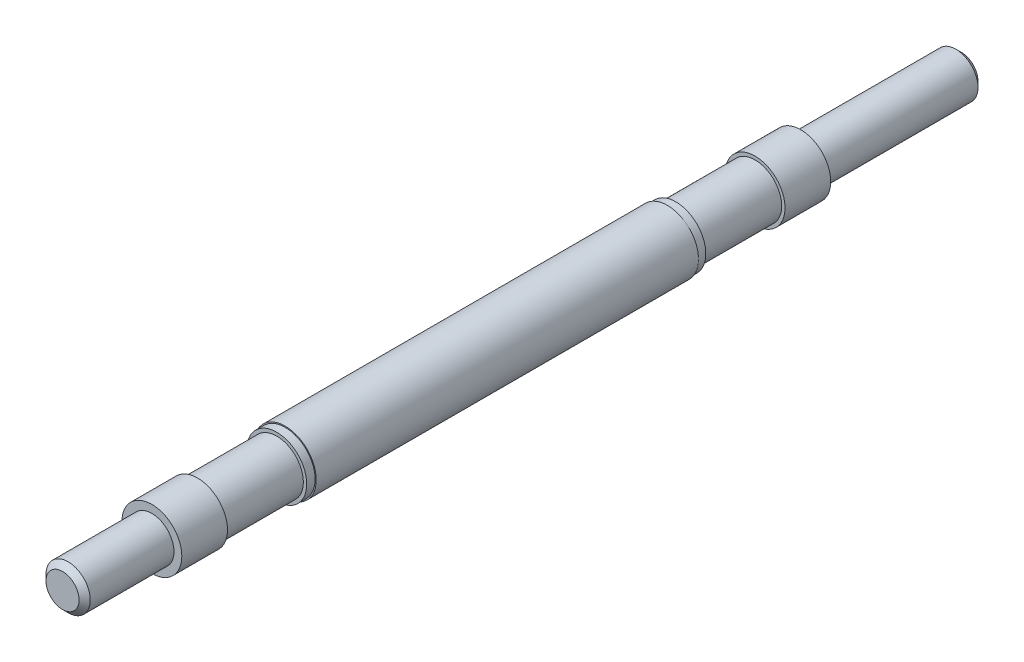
ISO-10303-21;
HEADER;
FILE_DESCRIPTION(('STEP AP214'),'2;1');
FILE_NAME('part.step','',(''),(''),'','','');
FILE_SCHEMA(('AUTOMOTIVE_DESIGN { 1 0 10303 214 1 1 1 1 }'));
ENDSEC;
DATA;
#1=APPLICATION_CONTEXT('core data for automotive mechanical design processes');
#2=APPLICATION_PROTOCOL_DEFINITION('international standard','automotive_design',2000,#1);
#3=PRODUCT_CONTEXT('',#1,'mechanical');
#4=PRODUCT('Part','Part','',(#3));
#5=PRODUCT_RELATED_PRODUCT_CATEGORY('part','',(#4));
#6=PRODUCT_DEFINITION_FORMATION('','',#4);
#7=PRODUCT_DEFINITION_CONTEXT('part definition',#1,'design');
#8=PRODUCT_DEFINITION('design','',#6,#7);
#9=PRODUCT_DEFINITION_SHAPE('','',#8);
#10=(LENGTH_UNIT() NAMED_UNIT(*) SI_UNIT(.MILLI.,.METRE.));
#11=(NAMED_UNIT(*) PLANE_ANGLE_UNIT() SI_UNIT($,.RADIAN.));
#12=(NAMED_UNIT(*) SI_UNIT($,.STERADIAN.) SOLID_ANGLE_UNIT());
#13=UNCERTAINTY_MEASURE_WITH_UNIT(LENGTH_MEASURE(1.E-05),#10,'distance_accuracy_value','');
#14=(GEOMETRIC_REPRESENTATION_CONTEXT(3) GLOBAL_UNCERTAINTY_ASSIGNED_CONTEXT((#13)) GLOBAL_UNIT_ASSIGNED_CONTEXT((#10,
#11,#12)) REPRESENTATION_CONTEXT('',''));
#15=CARTESIAN_POINT('',(0.,0.,0.));
#16=DIRECTION('',(0.,0.,1.));
#17=DIRECTION('',(1.,0.,0.));
#18=AXIS2_PLACEMENT_3D('',#15,#16,#17);
#19=CARTESIAN_POINT('',(0.,0.,-55.5));
#20=DIRECTION('',(0.,0.,-1.));
#21=DIRECTION('',(-1.,0.,0.));
#22=AXIS2_PLACEMENT_3D('',#19,#20,#21);
#23=CYLINDRICAL_SURFACE('',#22,10.7);
#24=CARTESIAN_POINT('',(0.,0.,-55.5));
#25=DIRECTION('',(0.,0.,-1.));
#26=DIRECTION('',(-1.,0.,0.));
#27=AXIS2_PLACEMENT_3D('',#24,#25,#26);
#28=CIRCLE('',#27,10.7);
#29=CARTESIAN_POINT('',(-10.7,0.,-55.5));
#30=VERTEX_POINT('',#29);
#31=EDGE_CURVE('E66',#30,#30,#28,.T.);
#32=ORIENTED_EDGE('',*,*,#31,.T.);
#33=EDGE_LOOP('',(#32));
#34=FACE_BOUND('',#33,.T.);
#35=CARTESIAN_POINT('',(0.,0.,-58.5));
#36=DIRECTION('',(0.,0.,-1.));
#37=DIRECTION('',(-1.,0.,0.));
#38=AXIS2_PLACEMENT_3D('',#35,#36,#37);
#39=CIRCLE('',#38,10.7);
#40=CARTESIAN_POINT('',(-10.7,0.,-58.5));
#41=VERTEX_POINT('',#40);
#42=EDGE_CURVE('E91',#41,#41,#39,.T.);
#43=ORIENTED_EDGE('',*,*,#42,.F.);
#44=EDGE_LOOP('',(#43));
#45=FACE_BOUND('',#44,.T.);
#46=ADVANCED_FACE('F37',(#34,#45),#23,.T.);
#47=CARTESIAN_POINT('',(0.,0.,81.));
#48=DIRECTION('',(0.,0.,1.));
#49=DIRECTION('',(1.,0.,0.));
#50=AXIS2_PLACEMENT_3D('',#47,#48,#49);
#51=CYLINDRICAL_SURFACE('',#50,10.7);
#52=CARTESIAN_POINT('',(0.,0.,81.));
#53=DIRECTION('',(0.,0.,1.));
#54=DIRECTION('',(1.,0.,0.));
#55=AXIS2_PLACEMENT_3D('',#52,#53,#54);
#56=CIRCLE('',#55,10.7);
#57=CARTESIAN_POINT('',(10.7,0.,81.));
#58=VERTEX_POINT('',#57);
#59=EDGE_CURVE('E60',#58,#58,#56,.T.);
#60=CARTESIAN_POINT('',(0.,0.,84.));
#61=DIRECTION('',(0.,0.,1.));
#62=DIRECTION('',(1.,0.,0.));
#63=AXIS2_PLACEMENT_3D('',#60,#61,#62);
#64=CIRCLE('',#63,10.7);
#65=CARTESIAN_POINT('',(10.7,0.,84.));
#66=VERTEX_POINT('',#65);
#67=EDGE_CURVE('E81',#66,#66,#64,.T.);
#68=CARTESIAN_POINT('',(10.7,0.,81.));
#69=CARTESIAN_POINT('',(10.7,0.,81.03125));
#70=CARTESIAN_POINT('',(10.7,0.,81.0625));
#71=CARTESIAN_POINT('',(10.7,0.,81.125));
#72=CARTESIAN_POINT('',(10.7,0.,81.15625));
#73=CARTESIAN_POINT('',(10.7,0.,81.21875));
#74=CARTESIAN_POINT('',(10.7,0.,81.25));
#75=CARTESIAN_POINT('',(10.7,0.,81.3125));
#76=CARTESIAN_POINT('',(10.7,0.,81.34375));
#77=CARTESIAN_POINT('',(10.7,0.,81.40625));
#78=CARTESIAN_POINT('',(10.7,0.,81.4375));
#79=CARTESIAN_POINT('',(10.7,0.,81.5));
#80=CARTESIAN_POINT('',(10.7,0.,81.53125));
#81=CARTESIAN_POINT('',(10.7,0.,81.59375));
#82=CARTESIAN_POINT('',(10.7,0.,81.625));
#83=CARTESIAN_POINT('',(10.7,0.,81.6875));
#84=CARTESIAN_POINT('',(10.7,0.,81.71875));
#85=CARTESIAN_POINT('',(10.7,0.,81.78125));
#86=CARTESIAN_POINT('',(10.7,0.,81.8125));
#87=CARTESIAN_POINT('',(10.7,0.,81.875));
#88=CARTESIAN_POINT('',(10.7,0.,81.90625));
#89=CARTESIAN_POINT('',(10.7,0.,81.96875));
#90=CARTESIAN_POINT('',(10.7,0.,82.));
#91=CARTESIAN_POINT('',(10.7,0.,82.0625));
#92=CARTESIAN_POINT('',(10.7,0.,82.09375));
#93=CARTESIAN_POINT('',(10.7,0.,82.15625));
#94=CARTESIAN_POINT('',(10.7,0.,82.1875));
#95=CARTESIAN_POINT('',(10.7,0.,82.25));
#96=CARTESIAN_POINT('',(10.7,0.,82.28125));
#97=CARTESIAN_POINT('',(10.7,0.,82.34375));
#98=CARTESIAN_POINT('',(10.7,0.,82.375));
#99=CARTESIAN_POINT('',(10.7,0.,82.4375));
#100=CARTESIAN_POINT('',(10.7,0.,82.46875));
#101=CARTESIAN_POINT('',(10.7,0.,82.53125));
#102=CARTESIAN_POINT('',(10.7,0.,82.5625));
#103=CARTESIAN_POINT('',(10.7,0.,82.625));
#104=CARTESIAN_POINT('',(10.7,0.,82.65625));
#105=CARTESIAN_POINT('',(10.7,0.,82.71875));
#106=CARTESIAN_POINT('',(10.7,0.,82.75));
#107=CARTESIAN_POINT('',(10.7,0.,82.8125));
#108=CARTESIAN_POINT('',(10.7,0.,82.84375));
#109=CARTESIAN_POINT('',(10.7,0.,82.90625));
#110=CARTESIAN_POINT('',(10.7,0.,82.9375));
#111=CARTESIAN_POINT('',(10.7,0.,83.));
#112=CARTESIAN_POINT('',(10.7,0.,83.03125));
#113=CARTESIAN_POINT('',(10.7,0.,83.09375));
#114=CARTESIAN_POINT('',(10.7,0.,83.125));
#115=CARTESIAN_POINT('',(10.7,0.,83.1875));
#116=CARTESIAN_POINT('',(10.7,0.,83.21875));
#117=CARTESIAN_POINT('',(10.7,0.,83.28125));
#118=CARTESIAN_POINT('',(10.7,0.,83.3125));
#119=CARTESIAN_POINT('',(10.7,0.,83.375));
#120=CARTESIAN_POINT('',(10.7,0.,83.40625));
#121=CARTESIAN_POINT('',(10.7,0.,83.46875));
#122=CARTESIAN_POINT('',(10.7,0.,83.5));
#123=CARTESIAN_POINT('',(10.7,0.,83.5625));
#124=CARTESIAN_POINT('',(10.7,0.,83.59375));
#125=CARTESIAN_POINT('',(10.7,0.,83.65625));
#126=CARTESIAN_POINT('',(10.7,0.,83.6875));
#127=CARTESIAN_POINT('',(10.7,0.,83.75));
#128=CARTESIAN_POINT('',(10.7,0.,83.78125));
#129=CARTESIAN_POINT('',(10.7,0.,83.84375));
#130=CARTESIAN_POINT('',(10.7,0.,83.875));
#131=CARTESIAN_POINT('',(10.7,0.,83.9375));
#132=CARTESIAN_POINT('',(10.7,0.,83.96875));
#133=CARTESIAN_POINT('',(10.7,0.,84.));
#134=B_SPLINE_CURVE_WITH_KNOTS('',3,(#68,#69,#70,#71,#72,#73,#74,#75,#76,#77,#78,#79,#80,#81,
#82,#83,#84,#85,#86,#87,#88,#89,#90,#91,#92,#93,#94,#95,#96,#97,#98,#99,#100,#101,#102,#103,
#104,#105,#106,#107,#108,#109,#110,#111,#112,#113,#114,#115,#116,#117,#118,#119,#120,#121,#122,
#123,#124,#125,#126,#127,#128,#129,#130,#131,#132,#133),.UNSPECIFIED.,.F.,.F.,(4,2,2,2,2,2,2,2,
2,2,2,2,2,2,2,2,2,2,2,2,2,2,2,2,2,2,2,2,2,2,2,2,4),(0.,0.0937499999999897,0.187499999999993,
0.281249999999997,0.374999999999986,0.46874999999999,0.562499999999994,0.656249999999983,
0.749999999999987,0.84374999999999,0.93749999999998,1.03124999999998,1.12499999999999,
1.21874999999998,1.31249999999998,1.40624999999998,1.49999999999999,1.59374999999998,
1.68749999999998,1.78124999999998,1.87499999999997,1.96874999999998,2.06249999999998,
2.15624999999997,2.24999999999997,2.34374999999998,2.43749999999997,2.53124999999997,
2.62499999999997,2.71874999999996,2.81249999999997,2.90624999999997,2.99999999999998),.UNSPECIFIED.);
#135=EDGE_CURVE('BSEAM118',#58,#66,#134,.T.);
#136=ORIENTED_EDGE('',*,*,#59,.T.);
#137=ORIENTED_EDGE('',*,*,#67,.F.);
#138=ORIENTED_EDGE('',*,*,#135,.T.);
#139=ORIENTED_EDGE('',*,*,#135,.F.);
#140=EDGE_LOOP('',(#136,#138,#137,#139));
#141=FACE_BOUND('',#140,.T.);
#142=ADVANCED_FACE('F118',(#141),#51,.T.);
#143=CARTESIAN_POINT('',(0.,0.,160.5));
#144=DIRECTION('',(0.,0.,-1.));
#145=DIRECTION('',(-1.,0.,0.));
#146=AXIS2_PLACEMENT_3D('',#143,#144,#145);
#147=CYLINDRICAL_SURFACE('',#146,11.1);
#148=CARTESIAN_POINT('',(0.,0.,81.));
#149=DIRECTION('',(0.,0.,1.));
#150=DIRECTION('',(1.,0.,0.));
#151=AXIS2_PLACEMENT_3D('',#148,#149,#150);
#152=CIRCLE('',#151,11.1);
#153=CARTESIAN_POINT('',(11.1,0.,81.));
#154=VERTEX_POINT('',#153);
#155=EDGE_CURVE('E57',#154,#154,#152,.T.);
#156=ORIENTED_EDGE('',*,*,#155,.F.);
#157=EDGE_LOOP('',(#156));
#158=FACE_BOUND('',#157,.T.);
#159=CARTESIAN_POINT('',(0.,0.,-55.5));
#160=DIRECTION('',(0.,0.,-1.));
#161=DIRECTION('',(-1.,0.,0.));
#162=AXIS2_PLACEMENT_3D('',#159,#160,#161);
#163=CIRCLE('',#162,11.1);
#164=CARTESIAN_POINT('',(-11.1,0.,-55.5));
#165=VERTEX_POINT('',#164);
#166=EDGE_CURVE('E63',#165,#165,#163,.T.);
#167=ORIENTED_EDGE('',*,*,#166,.F.);
#168=EDGE_LOOP('',(#167));
#169=FACE_BOUND('',#168,.T.);
#170=ADVANCED_FACE('F125',(#158,#169),#147,.T.);
#171=CARTESIAN_POINT('',(0.,0.,81.));
#172=DIRECTION('',(0.,0.,1.));
#173=DIRECTION('',(1.,0.,0.));
#174=AXIS2_PLACEMENT_3D('',#171,#172,#173);
#175=PLANE('',#174);
#176=ORIENTED_EDGE('',*,*,#59,.F.);
#177=EDGE_LOOP('',(#176));
#178=FACE_BOUND('',#177,.T.);
#179=ORIENTED_EDGE('',*,*,#155,.T.);
#180=EDGE_LOOP('',(#179));
#181=FACE_BOUND('',#180,.T.);
#182=ADVANCED_FACE('F188',(#178,#181),#175,.T.);
#183=CARTESIAN_POINT('',(0.,0.,-55.5));
#184=DIRECTION('',(0.,0.,-1.));
#185=DIRECTION('',(-1.,0.,0.));
#186=AXIS2_PLACEMENT_3D('',#183,#184,#185);
#187=PLANE('',#186);
#188=ORIENTED_EDGE('',*,*,#31,.F.);
#189=EDGE_LOOP('',(#188));
#190=FACE_BOUND('',#189,.T.);
#191=ORIENTED_EDGE('',*,*,#166,.T.);
#192=EDGE_LOOP('',(#191));
#193=FACE_BOUND('',#192,.T.);
#194=ADVANCED_FACE('F162',(#190,#193),#187,.T.);
#195=CARTESIAN_POINT('',(0.,0.,84.));
#196=DIRECTION('',(0.,0.,1.));
#197=DIRECTION('',(1.,0.,0.));
#198=AXIS2_PLACEMENT_3D('',#195,#196,#197);
#199=PLANE('',#198);
#200=CARTESIAN_POINT('',(0.,0.,84.));
#201=DIRECTION('',(0.,0.,1.));
#202=DIRECTION('',(1.,0.,0.));
#203=AXIS2_PLACEMENT_3D('',#200,#201,#202);
#204=CIRCLE('',#203,9.5);
#205=CARTESIAN_POINT('',(9.5,0.,84.));
#206=VERTEX_POINT('',#205);
#207=EDGE_CURVE('E85',#206,#206,#204,.T.);
#208=ORIENTED_EDGE('',*,*,#207,.F.);
#209=EDGE_LOOP('',(#208));
#210=FACE_BOUND('',#209,.T.);
#211=ORIENTED_EDGE('',*,*,#67,.T.);
#212=EDGE_LOOP('',(#211));
#213=FACE_BOUND('',#212,.T.);
#214=ADVANCED_FACE('F159',(#210,#213),#199,.T.);
#215=CARTESIAN_POINT('',(0.,0.,112.3));
#216=DIRECTION('',(0.,0.,1.));
#217=DIRECTION('',(1.,0.,0.));
#218=AXIS2_PLACEMENT_3D('',#215,#216,#217);
#219=PLANE('',#218);
#220=CARTESIAN_POINT('',(0.,0.,112.3));
#221=DIRECTION('',(0.,0.,1.));
#222=DIRECTION('',(1.,0.,0.));
#223=AXIS2_PLACEMENT_3D('',#220,#221,#222);
#224=CIRCLE('',#223,9.5);
#225=CARTESIAN_POINT('',(9.5,0.,112.3));
#226=VERTEX_POINT('',#225);
#227=EDGE_CURVE('E88',#226,#226,#224,.T.);
#228=ORIENTED_EDGE('',*,*,#227,.T.);
#229=EDGE_LOOP('',(#228));
#230=FACE_BOUND('',#229,.T.);
#231=CARTESIAN_POINT('',(0.,0.,112.3));
#232=DIRECTION('',(0.,0.,1.));
#233=DIRECTION('',(1.,0.,0.));
#234=AXIS2_PLACEMENT_3D('',#231,#232,#233);
#235=CIRCLE('',#234,10.7);
#236=CARTESIAN_POINT('',(10.7,0.,112.3));
#237=VERTEX_POINT('',#236);
#238=EDGE_CURVE('E82',#237,#237,#235,.T.);
#239=ORIENTED_EDGE('',*,*,#238,.F.);
#240=EDGE_LOOP('',(#239));
#241=FACE_BOUND('',#240,.T.);
#242=ADVANCED_FACE('F157',(#230,#241),#219,.F.);
#243=CARTESIAN_POINT('',(0.,0.,84.));
#244=DIRECTION('',(0.,0.,1.));
#245=DIRECTION('',(1.,0.,0.));
#246=AXIS2_PLACEMENT_3D('',#243,#244,#245);
#247=CYLINDRICAL_SURFACE('',#246,9.5);
#248=ORIENTED_EDGE('',*,*,#207,.T.);
#249=EDGE_LOOP('',(#248));
#250=FACE_BOUND('',#249,.T.);
#251=ORIENTED_EDGE('',*,*,#227,.F.);
#252=EDGE_LOOP('',(#251));
#253=FACE_BOUND('',#252,.T.);
#254=ADVANCED_FACE('F153',(#250,#253),#247,.T.);
#255=CARTESIAN_POINT('',(0.,0.,160.5));
#256=DIRECTION('',(0.,0.,1.));
#257=DIRECTION('',(1.,0.,0.));
#258=AXIS2_PLACEMENT_3D('',#255,#256,#257);
#259=PLANE('',#258);
#260=CARTESIAN_POINT('',(0.,0.,160.5));
#261=DIRECTION('',(0.,0.,1.));
#262=DIRECTION('',(1.,0.,0.));
#263=AXIS2_PLACEMENT_3D('',#260,#261,#262);
#264=CIRCLE('',#263,5.89999999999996);
#265=CARTESIAN_POINT('',(5.89999999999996,0.,160.5));
#266=VERTEX_POINT('',#265);
#267=EDGE_CURVE('E44',#266,#266,#264,.T.);
#268=ORIENTED_EDGE('',*,*,#267,.T.);
#269=EDGE_LOOP('',(#268));
#270=FACE_BOUND('',#269,.T.);
#271=ADVANCED_FACE('F156',(#270),#259,.T.);
#272=CARTESIAN_POINT('',(0.,0.,160.5));
#273=DIRECTION('',(0.,0.,-1.));
#274=DIRECTION('',(-1.,0.,0.));
#275=AXIS2_PLACEMENT_3D('',#272,#273,#274);
#276=CONICAL_SURFACE('',#275,5.89999999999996,0.785398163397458);
#277=CARTESIAN_POINT('',(0.,0.,158.5));
#278=DIRECTION('',(0.,0.,1.));
#279=DIRECTION('',(1.,0.,0.));
#280=AXIS2_PLACEMENT_3D('',#277,#278,#279);
#281=CIRCLE('',#280,7.9);
#282=CARTESIAN_POINT('',(7.9,0.,158.5));
#283=VERTEX_POINT('',#282);
#284=EDGE_CURVE('E10',#283,#283,#281,.F.);
#285=ORIENTED_EDGE('',*,*,#284,.F.);
#286=EDGE_LOOP('',(#285));
#287=FACE_BOUND('',#286,.T.);
#288=ORIENTED_EDGE('',*,*,#267,.F.);
#289=EDGE_LOOP('',(#288));
#290=FACE_BOUND('',#289,.T.);
#291=ADVANCED_FACE('F39',(#287,#290),#276,.T.);
#292=CARTESIAN_POINT('',(0.,0.,128.6));
#293=DIRECTION('',(0.,0.,1.));
#294=DIRECTION('',(1.,0.,0.));
#295=AXIS2_PLACEMENT_3D('',#292,#293,#294);
#296=CYLINDRICAL_SURFACE('',#295,7.9);
#297=ORIENTED_EDGE('',*,*,#284,.T.);
#298=EDGE_LOOP('',(#297));
#299=FACE_BOUND('',#298,.T.);
#300=CARTESIAN_POINT('',(0.,0.,128.6));
#301=DIRECTION('',(0.,0.,1.));
#302=DIRECTION('',(1.,0.,0.));
#303=AXIS2_PLACEMENT_3D('',#300,#301,#302);
#304=CIRCLE('',#303,7.9);
#305=CARTESIAN_POINT('',(7.9,0.,128.6));
#306=VERTEX_POINT('',#305);
#307=EDGE_CURVE('E72',#306,#306,#304,.T.);
#308=ORIENTED_EDGE('',*,*,#307,.T.);
#309=EDGE_LOOP('',(#308));
#310=FACE_BOUND('',#309,.T.);
#311=ADVANCED_FACE('F171',(#299,#310),#296,.T.);
#312=CARTESIAN_POINT('',(0.,0.,128.6));
#313=DIRECTION('',(0.,0.,1.));
#314=DIRECTION('',(1.,0.,0.));
#315=AXIS2_PLACEMENT_3D('',#312,#313,#314);
#316=PLANE('',#315);
#317=ORIENTED_EDGE('',*,*,#307,.F.);
#318=EDGE_LOOP('',(#317));
#319=FACE_BOUND('',#318,.T.);
#320=CARTESIAN_POINT('',(0.,0.,128.6));
#321=DIRECTION('',(0.,0.,1.));
#322=DIRECTION('',(1.,0.,0.));
#323=AXIS2_PLACEMENT_3D('',#320,#321,#322);
#324=CIRCLE('',#323,10.7);
#325=CARTESIAN_POINT('',(10.7,0.,128.6));
#326=VERTEX_POINT('',#325);
#327=EDGE_CURVE('E69',#326,#326,#324,.T.);
#328=ORIENTED_EDGE('',*,*,#327,.T.);
#329=EDGE_LOOP('',(#328));
#330=FACE_BOUND('',#329,.T.);
#331=ADVANCED_FACE('F173',(#319,#330),#316,.T.);
#332=CARTESIAN_POINT('',(10.7,0.,112.3));
#333=CARTESIAN_POINT('',(10.7,0.,112.469791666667));
#334=CARTESIAN_POINT('',(10.7,0.,112.639583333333));
#335=CARTESIAN_POINT('',(10.7,0.,112.979166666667));
#336=CARTESIAN_POINT('',(10.7,0.,113.148958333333));
#337=CARTESIAN_POINT('',(10.7,0.,113.488541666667));
#338=CARTESIAN_POINT('',(10.7,0.,113.658333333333));
#339=CARTESIAN_POINT('',(10.7,0.,113.997916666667));
#340=CARTESIAN_POINT('',(10.7,0.,114.167708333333));
#341=CARTESIAN_POINT('',(10.7,0.,114.507291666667));
#342=CARTESIAN_POINT('',(10.7,0.,114.677083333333));
#343=CARTESIAN_POINT('',(10.7,0.,115.016666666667));
#344=CARTESIAN_POINT('',(10.7,0.,115.186458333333));
#345=CARTESIAN_POINT('',(10.7,0.,115.526041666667));
#346=CARTESIAN_POINT('',(10.7,0.,115.695833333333));
#347=CARTESIAN_POINT('',(10.7,0.,116.035416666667));
#348=CARTESIAN_POINT('',(10.7,0.,116.205208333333));
#349=CARTESIAN_POINT('',(10.7,0.,116.544791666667));
#350=CARTESIAN_POINT('',(10.7,0.,116.714583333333));
#351=CARTESIAN_POINT('',(10.7,0.,117.054166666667));
#352=CARTESIAN_POINT('',(10.7,0.,117.223958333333));
#353=CARTESIAN_POINT('',(10.7,0.,117.563541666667));
#354=CARTESIAN_POINT('',(10.7,0.,117.733333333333));
#355=CARTESIAN_POINT('',(10.7,0.,118.072916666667));
#356=CARTESIAN_POINT('',(10.7,0.,118.242708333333));
#357=CARTESIAN_POINT('',(10.7,0.,118.582291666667));
#358=CARTESIAN_POINT('',(10.7,0.,118.752083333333));
#359=CARTESIAN_POINT('',(10.7,0.,119.091666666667));
#360=CARTESIAN_POINT('',(10.7,0.,119.261458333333));
#361=CARTESIAN_POINT('',(10.7,0.,119.601041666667));
#362=CARTESIAN_POINT('',(10.7,0.,119.770833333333));
#363=CARTESIAN_POINT('',(10.7,0.,120.110416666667));
#364=CARTESIAN_POINT('',(10.7,0.,120.280208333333));
#365=CARTESIAN_POINT('',(10.7,0.,120.619791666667));
#366=CARTESIAN_POINT('',(10.7,0.,120.789583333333));
#367=CARTESIAN_POINT('',(10.7,0.,121.129166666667));
#368=CARTESIAN_POINT('',(10.7,0.,121.298958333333));
#369=CARTESIAN_POINT('',(10.7,0.,121.638541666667));
#370=CARTESIAN_POINT('',(10.7,0.,121.808333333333));
#371=CARTESIAN_POINT('',(10.7,0.,122.147916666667));
#372=CARTESIAN_POINT('',(10.7,0.,122.317708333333));
#373=CARTESIAN_POINT('',(10.7,0.,122.657291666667));
#374=CARTESIAN_POINT('',(10.7,0.,122.827083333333));
#375=CARTESIAN_POINT('',(10.7,0.,123.166666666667));
#376=CARTESIAN_POINT('',(10.7,0.,123.336458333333));
#377=CARTESIAN_POINT('',(10.7,0.,123.676041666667));
#378=CARTESIAN_POINT('',(10.7,0.,123.845833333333));
#379=CARTESIAN_POINT('',(10.7,0.,124.185416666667));
#380=CARTESIAN_POINT('',(10.7,0.,124.355208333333));
#381=CARTESIAN_POINT('',(10.7,0.,124.694791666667));
#382=CARTESIAN_POINT('',(10.7,0.,124.864583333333));
#383=CARTESIAN_POINT('',(10.7,0.,125.204166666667));
#384=CARTESIAN_POINT('',(10.7,0.,125.373958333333));
#385=CARTESIAN_POINT('',(10.7,0.,125.713541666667));
#386=CARTESIAN_POINT('',(10.7,0.,125.883333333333));
#387=CARTESIAN_POINT('',(10.7,0.,126.222916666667));
#388=CARTESIAN_POINT('',(10.7,0.,126.392708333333));
#389=CARTESIAN_POINT('',(10.7,0.,126.732291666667));
#390=CARTESIAN_POINT('',(10.7,0.,126.902083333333));
#391=CARTESIAN_POINT('',(10.7,0.,127.241666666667));
#392=CARTESIAN_POINT('',(10.7,0.,127.411458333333));
#393=CARTESIAN_POINT('',(10.7,0.,127.751041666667));
#394=CARTESIAN_POINT('',(10.7,0.,127.920833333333));
#395=CARTESIAN_POINT('',(10.7,0.,128.260416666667));
#396=CARTESIAN_POINT('',(10.7,0.,128.430208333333));
#397=CARTESIAN_POINT('',(10.7,0.,128.6));
#398=B_SPLINE_CURVE_WITH_KNOTS('',3,(#332,#333,#334,#335,#336,#337,#338,#339,#340,#341,#342,
#343,#344,#345,#346,#347,#348,#349,#350,#351,#352,#353,#354,#355,#356,#357,#358,#359,#360,#361,
#362,#363,#364,#365,#366,#367,#368,#369,#370,#371,#372,#373,#374,#375,#376,#377,#378,#379,#380,
#381,#382,#383,#384,#385,#386,#387,#388,#389,#390,#391,#392,#393,#394,#395,#396,#397),
.UNSPECIFIED.,.F.,.F.,(4,2,2,2,2,2,2,2,2,2,2,2,2,2,2,2,2,2,2,2,2,2,2,2,2,2,2,2,2,2,2,2,4),(0.,
0.509374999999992,1.01874999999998,1.52812499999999,2.0375,2.54687499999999,3.05624999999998,
3.56562499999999,4.075,4.584375,5.09374999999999,5.60312499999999,6.11249999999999,6.621875,
7.13124999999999,7.64062499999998,8.14999999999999,8.659375,9.16874999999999,9.67812499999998,
10.1875,10.696875,11.20625,11.715625,12.225,12.734375,13.24375,13.753125,14.2625,14.771875,
15.28125,15.790625,16.3),.UNSPECIFIED.);
#399=EDGE_CURVE('BSEAM113',#237,#326,#398,.T.);
#400=ORIENTED_EDGE('',*,*,#238,.T.);
#401=ORIENTED_EDGE('',*,*,#327,.F.);
#402=ORIENTED_EDGE('',*,*,#399,.T.);
#403=ORIENTED_EDGE('',*,*,#399,.F.);
#404=EDGE_LOOP('',(#400,#402,#401,#403));
#405=FACE_BOUND('',#404,.T.);
#406=ADVANCED_FACE('F113',(#405),#51,.T.);
#407=CARTESIAN_POINT('',(0.,0.,-58.5));
#408=DIRECTION('',(0.,0.,-1.));
#409=DIRECTION('',(-1.,0.,0.));
#410=AXIS2_PLACEMENT_3D('',#407,#408,#409);
#411=PLANE('',#410);
#412=CARTESIAN_POINT('',(0.,0.,-58.5));
#413=DIRECTION('',(0.,0.,-1.));
#414=DIRECTION('',(-1.,0.,0.));
#415=AXIS2_PLACEMENT_3D('',#412,#413,#414);
#416=CIRCLE('',#415,9.5);
#417=CARTESIAN_POINT('',(-9.5,0.,-58.5));
#418=VERTEX_POINT('',#417);
#419=EDGE_CURVE('E97',#418,#418,#416,.T.);
#420=ORIENTED_EDGE('',*,*,#419,.F.);
#421=EDGE_LOOP('',(#420));
#422=FACE_BOUND('',#421,.T.);
#423=ORIENTED_EDGE('',*,*,#42,.T.);
#424=EDGE_LOOP('',(#423));
#425=FACE_BOUND('',#424,.T.);
#426=ADVANCED_FACE('F109',(#422,#425),#411,.T.);
#427=CARTESIAN_POINT('',(0.,0.,-86.8));
#428=DIRECTION('',(0.,0.,-1.));
#429=DIRECTION('',(-1.,0.,0.));
#430=AXIS2_PLACEMENT_3D('',#427,#428,#429);
#431=PLANE('',#430);
#432=CARTESIAN_POINT('',(0.,0.,-86.8));
#433=DIRECTION('',(0.,0.,-1.));
#434=DIRECTION('',(-1.,0.,0.));
#435=AXIS2_PLACEMENT_3D('',#432,#433,#434);
#436=CIRCLE('',#435,9.5);
#437=CARTESIAN_POINT('',(-9.5,0.,-86.8));
#438=VERTEX_POINT('',#437);
#439=EDGE_CURVE('E100',#438,#438,#436,.T.);
#440=ORIENTED_EDGE('',*,*,#439,.T.);
#441=EDGE_LOOP('',(#440));
#442=FACE_BOUND('',#441,.T.);
#443=CARTESIAN_POINT('',(0.,0.,-86.8));
#444=DIRECTION('',(0.,0.,-1.));
#445=DIRECTION('',(-1.,0.,0.));
#446=AXIS2_PLACEMENT_3D('',#443,#444,#445);
#447=CIRCLE('',#446,10.7);
#448=CARTESIAN_POINT('',(-10.7,0.,-86.8));
#449=VERTEX_POINT('',#448);
#450=EDGE_CURVE('E94',#449,#449,#447,.T.);
#451=ORIENTED_EDGE('',*,*,#450,.F.);
#452=EDGE_LOOP('',(#451));
#453=FACE_BOUND('',#452,.T.);
#454=ADVANCED_FACE('F112',(#442,#453),#431,.F.);
#455=CARTESIAN_POINT('',(0.,0.,-58.5));
#456=DIRECTION('',(0.,0.,-1.));
#457=DIRECTION('',(-1.,0.,0.));
#458=AXIS2_PLACEMENT_3D('',#455,#456,#457);
#459=CYLINDRICAL_SURFACE('',#458,9.5);
#460=ORIENTED_EDGE('',*,*,#419,.T.);
#461=EDGE_LOOP('',(#460));
#462=FACE_BOUND('',#461,.T.);
#463=ORIENTED_EDGE('',*,*,#439,.F.);
#464=EDGE_LOOP('',(#463));
#465=FACE_BOUND('',#464,.T.);
#466=ADVANCED_FACE('F106',(#462,#465),#459,.T.);
#467=CARTESIAN_POINT('',(0.,0.,-160.5));
#468=DIRECTION('',(0.,0.,1.));
#469=DIRECTION('',(1.,0.,0.));
#470=AXIS2_PLACEMENT_3D('',#467,#468,#469);
#471=PLANE('',#470);
#472=CARTESIAN_POINT('',(0.,0.,-160.5));
#473=DIRECTION('',(0.,0.,1.));
#474=DIRECTION('',(1.,0.,0.));
#475=AXIS2_PLACEMENT_3D('',#472,#473,#474);
#476=CIRCLE('',#475,5.89999999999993);
#477=CARTESIAN_POINT('',(5.89999999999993,0.,-160.5));
#478=VERTEX_POINT('',#477);
#479=EDGE_CURVE('E52',#478,#478,#476,.F.);
#480=ORIENTED_EDGE('',*,*,#479,.T.);
#481=EDGE_LOOP('',(#480));
#482=FACE_BOUND('',#481,.T.);
#483=ADVANCED_FACE('F150',(#482),#471,.F.);
#484=CARTESIAN_POINT('',(0.,0.,-160.5));
#485=DIRECTION('',(0.,0.,1.));
#486=DIRECTION('',(1.,0.,0.));
#487=AXIS2_PLACEMENT_3D('',#484,#485,#486);
#488=CONICAL_SURFACE('',#487,5.89999999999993,0.785398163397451);
#489=CARTESIAN_POINT('',(0.,0.,-158.5));
#490=DIRECTION('',(0.,0.,1.));
#491=DIRECTION('',(1.,0.,0.));
#492=AXIS2_PLACEMENT_3D('',#489,#490,#491);
#493=CIRCLE('',#492,7.9);
#494=CARTESIAN_POINT('',(7.9,0.,-158.5));
#495=VERTEX_POINT('',#494);
#496=EDGE_CURVE('E48',#495,#495,#493,.T.);
#497=ORIENTED_EDGE('',*,*,#496,.F.);
#498=EDGE_LOOP('',(#497));
#499=FACE_BOUND('',#498,.T.);
#500=ORIENTED_EDGE('',*,*,#479,.F.);
#501=EDGE_LOOP('',(#500));
#502=FACE_BOUND('',#501,.T.);
#503=ADVANCED_FACE('F168',(#499,#502),#488,.T.);
#504=CARTESIAN_POINT('',(0.,0.,-103.1));
#505=DIRECTION('',(0.,0.,-1.));
#506=DIRECTION('',(-1.,0.,0.));
#507=AXIS2_PLACEMENT_3D('',#504,#505,#506);
#508=CYLINDRICAL_SURFACE('',#507,7.9);
#509=ORIENTED_EDGE('',*,*,#496,.T.);
#510=EDGE_LOOP('',(#509));
#511=FACE_BOUND('',#510,.T.);
#512=CARTESIAN_POINT('',(0.,0.,-103.1));
#513=DIRECTION('',(0.,0.,-1.));
#514=DIRECTION('',(-1.,0.,0.));
#515=AXIS2_PLACEMENT_3D('',#512,#513,#514);
#516=CIRCLE('',#515,7.9);
#517=CARTESIAN_POINT('',(-7.9,0.,-103.1));
#518=VERTEX_POINT('',#517);
#519=EDGE_CURVE('E78',#518,#518,#516,.T.);
#520=ORIENTED_EDGE('',*,*,#519,.T.);
#521=EDGE_LOOP('',(#520));
#522=FACE_BOUND('',#521,.T.);
#523=ADVANCED_FACE('F136',(#511,#522),#508,.T.);
#524=CARTESIAN_POINT('',(0.,0.,-103.1));
#525=DIRECTION('',(0.,0.,-1.));
#526=DIRECTION('',(-1.,0.,0.));
#527=AXIS2_PLACEMENT_3D('',#524,#525,#526);
#528=PLANE('',#527);
#529=ORIENTED_EDGE('',*,*,#519,.F.);
#530=EDGE_LOOP('',(#529));
#531=FACE_BOUND('',#530,.T.);
#532=CARTESIAN_POINT('',(0.,0.,-103.1));
#533=DIRECTION('',(0.,0.,-1.));
#534=DIRECTION('',(-1.,0.,0.));
#535=AXIS2_PLACEMENT_3D('',#532,#533,#534);
#536=CIRCLE('',#535,10.7);
#537=CARTESIAN_POINT('',(-10.7,0.,-103.1));
#538=VERTEX_POINT('',#537);
#539=EDGE_CURVE('E75',#538,#538,#536,.T.);
#540=ORIENTED_EDGE('',*,*,#539,.T.);
#541=EDGE_LOOP('',(#540));
#542=FACE_BOUND('',#541,.T.);
#543=ADVANCED_FACE('F131',(#531,#542),#528,.T.);
#544=ORIENTED_EDGE('',*,*,#450,.T.);
#545=EDGE_LOOP('',(#544));
#546=FACE_BOUND('',#545,.T.);
#547=ORIENTED_EDGE('',*,*,#539,.F.);
#548=EDGE_LOOP('',(#547));
#549=FACE_BOUND('',#548,.T.);
#550=ADVANCED_FACE('F121',(#546,#549),#23,.T.);
#551=CLOSED_SHELL('',(#46,#142,#170,#182,#194,#214,#242,#254,#271,#291,#311,#331,#406,#426,#454,
#466,#483,#503,#523,#543,#550));
#552=MANIFOLD_SOLID_BREP('B2',#551);
#553=ADVANCED_BREP_SHAPE_REPRESENTATION('',(#18,#552),#14);
#554=SHAPE_DEFINITION_REPRESENTATION(#9,#553);
ENDSEC;
END-ISO-10303-21;
